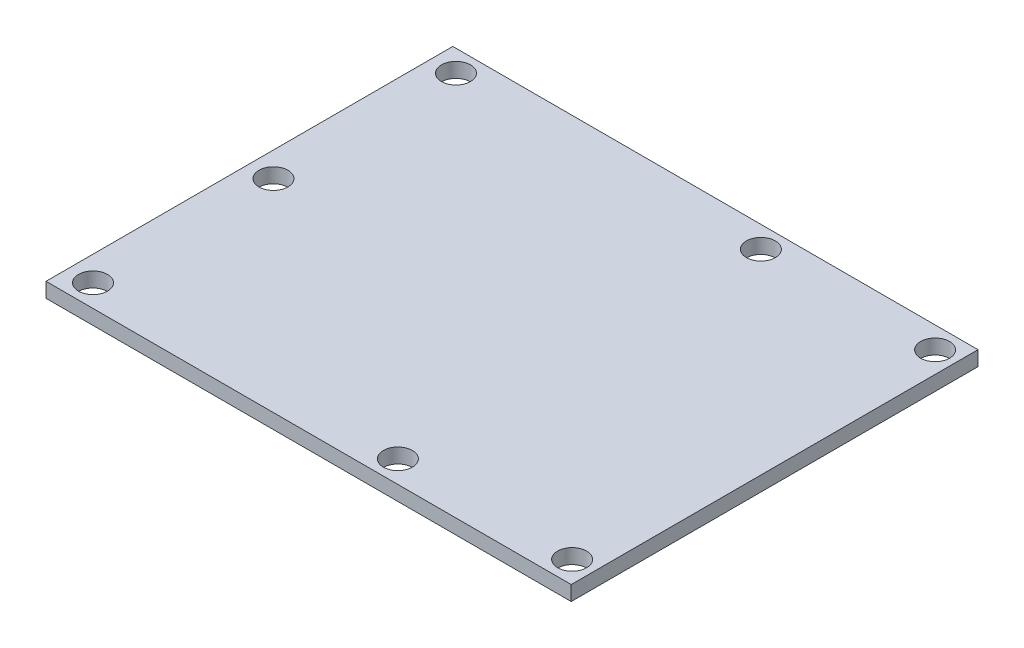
ISO-10303-21;
HEADER;
FILE_DESCRIPTION(('STEP AP214'),'2;1');
FILE_NAME('part.step','',(''),(''),'','','');
FILE_SCHEMA(('AUTOMOTIVE_DESIGN { 1 0 10303 214 1 1 1 1 }'));
ENDSEC;
DATA;
#1=APPLICATION_CONTEXT('core data for automotive mechanical design processes');
#2=APPLICATION_PROTOCOL_DEFINITION('international standard','automotive_design',2000,#1);
#3=PRODUCT_CONTEXT('',#1,'mechanical');
#4=PRODUCT('Part','Part','',(#3));
#5=PRODUCT_RELATED_PRODUCT_CATEGORY('part','',(#4));
#6=PRODUCT_DEFINITION_FORMATION('','',#4);
#7=PRODUCT_DEFINITION_CONTEXT('part definition',#1,'design');
#8=PRODUCT_DEFINITION('design','',#6,#7);
#9=PRODUCT_DEFINITION_SHAPE('','',#8);
#10=(LENGTH_UNIT() NAMED_UNIT(*) SI_UNIT(.MILLI.,.METRE.));
#11=(NAMED_UNIT(*) PLANE_ANGLE_UNIT() SI_UNIT($,.RADIAN.));
#12=(NAMED_UNIT(*) SI_UNIT($,.STERADIAN.) SOLID_ANGLE_UNIT());
#13=UNCERTAINTY_MEASURE_WITH_UNIT(LENGTH_MEASURE(1.E-05),#10,'distance_accuracy_value','');
#14=(GEOMETRIC_REPRESENTATION_CONTEXT(3) GLOBAL_UNCERTAINTY_ASSIGNED_CONTEXT((#13)) GLOBAL_UNIT_ASSIGNED_CONTEXT((#10,
#11,#12)) REPRESENTATION_CONTEXT('',''));
#15=CARTESIAN_POINT('',(0.,0.,0.));
#16=DIRECTION('',(0.,0.,1.));
#17=DIRECTION('',(1.,0.,0.));
#18=AXIS2_PLACEMENT_3D('',#15,#16,#17);
#19=CARTESIAN_POINT('',(-48.8419319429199,-2.,17.094676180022));
#20=DIRECTION('',(-1.,0.,0.));
#21=DIRECTION('',(0.,0.,1.));
#22=AXIS2_PLACEMENT_3D('',#19,#20,#21);
#23=PLANE('',#22);
#24=DIRECTION('',(0.,0.,1.));
#25=VECTOR('',#24,1.);
#26=CARTESIAN_POINT('',(-48.8419319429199,0.,17.094676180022));
#27=LINE('',#26,#25);
#28=CARTESIAN_POINT('',(-48.8419319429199,0.,-38.0269327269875));
#29=VERTEX_POINT('',#28);
#30=CARTESIAN_POINT('',(-48.8419319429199,0.,17.094676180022));
#31=VERTEX_POINT('',#30);
#32=EDGE_CURVE('E99',#29,#31,#27,.T.);
#33=ORIENTED_EDGE('',*,*,#32,.F.);
#34=DIRECTION('',(0.,1.,0.));
#35=VECTOR('',#34,1.);
#36=CARTESIAN_POINT('',(-48.8419319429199,-2.,-38.0269327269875));
#37=LINE('',#36,#35);
#38=CARTESIAN_POINT('',(-48.8419319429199,-2.,-38.0269327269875));
#39=VERTEX_POINT('',#38);
#40=EDGE_CURVE('E11',#39,#29,#37,.T.);
#41=ORIENTED_EDGE('',*,*,#40,.F.);
#42=DIRECTION('',(0.,0.,1.));
#43=VECTOR('',#42,1.);
#44=CARTESIAN_POINT('',(-48.8419319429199,-2.,17.094676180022));
#45=LINE('',#44,#43);
#46=CARTESIAN_POINT('',(-48.8419319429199,-2.,17.094676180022));
#47=VERTEX_POINT('',#46);
#48=EDGE_CURVE('E92',#39,#47,#45,.T.);
#49=ORIENTED_EDGE('',*,*,#48,.T.);
#50=DIRECTION('',(0.,1.,0.));
#51=VECTOR('',#50,1.);
#52=CARTESIAN_POINT('',(-48.8419319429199,-2.,17.094676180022));
#53=LINE('',#52,#51);
#54=EDGE_CURVE('E37',#47,#31,#53,.T.);
#55=ORIENTED_EDGE('',*,*,#54,.T.);
#56=EDGE_LOOP('',(#33,#41,#49,#55));
#57=FACE_BOUND('',#56,.T.);
#58=ADVANCED_FACE('F34',(#57),#23,.T.);
#59=CARTESIAN_POINT('',(-48.8419319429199,-2.,-38.0269327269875));
#60=DIRECTION('',(0.,0.,-1.));
#61=DIRECTION('',(-1.,0.,0.));
#62=AXIS2_PLACEMENT_3D('',#59,#60,#61);
#63=PLANE('',#62);
#64=DIRECTION('',(-1.,0.,0.));
#65=VECTOR('',#64,1.);
#66=CARTESIAN_POINT('',(-48.8419319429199,0.,-38.0269327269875));
#67=LINE('',#66,#65);
#68=CARTESIAN_POINT('',(22.3277403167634,0.,-38.0269327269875));
#69=VERTEX_POINT('',#68);
#70=EDGE_CURVE('E94',#69,#29,#67,.T.);
#71=ORIENTED_EDGE('',*,*,#70,.F.);
#72=DIRECTION('',(0.,1.,0.));
#73=VECTOR('',#72,1.);
#74=CARTESIAN_POINT('',(22.3277403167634,-2.,-38.0269327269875));
#75=LINE('',#74,#73);
#76=CARTESIAN_POINT('',(22.3277403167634,-2.,-38.0269327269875));
#77=VERTEX_POINT('',#76);
#78=EDGE_CURVE('E43',#77,#69,#75,.T.);
#79=ORIENTED_EDGE('',*,*,#78,.F.);
#80=DIRECTION('',(-1.,0.,0.));
#81=VECTOR('',#80,1.);
#82=CARTESIAN_POINT('',(-48.8419319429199,-2.,-38.0269327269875));
#83=LINE('',#82,#81);
#84=EDGE_CURVE('E89',#77,#39,#83,.T.);
#85=ORIENTED_EDGE('',*,*,#84,.T.);
#86=ORIENTED_EDGE('',*,*,#40,.T.);
#87=EDGE_LOOP('',(#71,#79,#85,#86));
#88=FACE_BOUND('',#87,.T.);
#89=ADVANCED_FACE('F110',(#88),#63,.T.);
#90=CARTESIAN_POINT('',(22.3277403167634,-2.,-38.0269327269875));
#91=DIRECTION('',(1.,0.,0.));
#92=DIRECTION('',(0.,0.,-1.));
#93=AXIS2_PLACEMENT_3D('',#90,#91,#92);
#94=PLANE('',#93);
#95=DIRECTION('',(0.,0.,-1.));
#96=VECTOR('',#95,1.);
#97=CARTESIAN_POINT('',(22.3277403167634,0.,-38.0269327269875));
#98=LINE('',#97,#96);
#99=CARTESIAN_POINT('',(22.3277403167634,0.,17.094676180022));
#100=VERTEX_POINT('',#99);
#101=EDGE_CURVE('E84',#100,#69,#98,.T.);
#102=ORIENTED_EDGE('',*,*,#101,.F.);
#103=DIRECTION('',(0.,1.,0.));
#104=VECTOR('',#103,1.);
#105=CARTESIAN_POINT('',(22.3277403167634,-2.,17.094676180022));
#106=LINE('',#105,#104);
#107=CARTESIAN_POINT('',(22.3277403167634,-2.,17.094676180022));
#108=VERTEX_POINT('',#107);
#109=EDGE_CURVE('E79',#108,#100,#106,.T.);
#110=ORIENTED_EDGE('',*,*,#109,.F.);
#111=DIRECTION('',(0.,0.,-1.));
#112=VECTOR('',#111,1.);
#113=CARTESIAN_POINT('',(22.3277403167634,-2.,-38.0269327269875));
#114=LINE('',#113,#112);
#115=EDGE_CURVE('E82',#108,#77,#114,.T.);
#116=ORIENTED_EDGE('',*,*,#115,.T.);
#117=ORIENTED_EDGE('',*,*,#78,.T.);
#118=EDGE_LOOP('',(#102,#110,#116,#117));
#119=FACE_BOUND('',#118,.T.);
#120=ADVANCED_FACE('F81',(#119),#94,.T.);
#121=CARTESIAN_POINT('',(22.3277403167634,-2.,17.094676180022));
#122=DIRECTION('',(0.,0.,1.));
#123=DIRECTION('',(1.,0.,0.));
#124=AXIS2_PLACEMENT_3D('',#121,#122,#123);
#125=PLANE('',#124);
#126=DIRECTION('',(1.,0.,0.));
#127=VECTOR('',#126,1.);
#128=CARTESIAN_POINT('',(22.3277403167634,0.,17.094676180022));
#129=LINE('',#128,#127);
#130=EDGE_CURVE('E102',#31,#100,#129,.T.);
#131=ORIENTED_EDGE('',*,*,#130,.F.);
#132=ORIENTED_EDGE('',*,*,#54,.F.);
#133=DIRECTION('',(1.,0.,0.));
#134=VECTOR('',#133,1.);
#135=CARTESIAN_POINT('',(22.3277403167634,-2.,17.094676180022));
#136=LINE('',#135,#134);
#137=EDGE_CURVE('E88',#47,#108,#136,.T.);
#138=ORIENTED_EDGE('',*,*,#137,.T.);
#139=ORIENTED_EDGE('',*,*,#109,.T.);
#140=EDGE_LOOP('',(#131,#132,#138,#139));
#141=FACE_BOUND('',#140,.T.);
#142=ADVANCED_FACE('F91',(#141),#125,.T.);
#143=CARTESIAN_POINT('',(0.,-2.,0.));
#144=DIRECTION('',(0.,-1.,0.));
#145=DIRECTION('',(0.,0.,-1.));
#146=AXIS2_PLACEMENT_3D('',#143,#144,#145);
#147=PLANE('',#146);
#148=CARTESIAN_POINT('',(-45.48365575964,-2.,14.0853852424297));
#149=DIRECTION('',(0.,-1.,0.));
#150=DIRECTION('',(0.,0.,-1.));
#151=AXIS2_PLACEMENT_3D('',#148,#149,#150);
#152=CIRCLE('',#151,1.96430419);
#153=CARTESIAN_POINT('',(-45.48365575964,-2.,12.1210810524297));
#154=VERTEX_POINT('',#153);
#155=EDGE_CURVE('E103',#154,#154,#152,.T.);
#156=ORIENTED_EDGE('',*,*,#155,.F.);
#157=EDGE_LOOP('',(#156));
#158=FACE_BOUND('',#157,.T.);
#159=CARTESIAN_POINT('',(-4.16742302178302,-2.,14.0853852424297));
#160=DIRECTION('',(0.,-1.,0.));
#161=DIRECTION('',(0.,0.,-1.));
#162=AXIS2_PLACEMENT_3D('',#159,#160,#161);
#163=CIRCLE('',#162,1.96430419);
#164=CARTESIAN_POINT('',(-4.16742302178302,-2.,12.1210810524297));
#165=VERTEX_POINT('',#164);
#166=EDGE_CURVE('E202',#165,#165,#163,.T.);
#167=ORIENTED_EDGE('',*,*,#166,.F.);
#168=EDGE_LOOP('',(#167));
#169=FACE_BOUND('',#168,.T.);
#170=CARTESIAN_POINT('',(19.4418528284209,-2.,14.0853852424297));
#171=DIRECTION('',(0.,-1.,0.));
#172=DIRECTION('',(0.,0.,-1.));
#173=AXIS2_PLACEMENT_3D('',#170,#171,#172);
#174=CIRCLE('',#173,1.96430419);
#175=CARTESIAN_POINT('',(19.4418528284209,-2.,12.1210810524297));
#176=VERTEX_POINT('',#175);
#177=EDGE_CURVE('E199',#176,#176,#174,.T.);
#178=ORIENTED_EDGE('',*,*,#177,.F.);
#179=EDGE_LOOP('',(#178));
#180=FACE_BOUND('',#179,.T.);
#181=CARTESIAN_POINT('',(19.4418528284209,-2.,-35.100606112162));
#182=DIRECTION('',(0.,-1.,0.));
#183=DIRECTION('',(0.,0.,-1.));
#184=AXIS2_PLACEMENT_3D('',#181,#182,#183);
#185=CIRCLE('',#184,1.96430419);
#186=CARTESIAN_POINT('',(19.4418528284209,-2.,-37.064910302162));
#187=VERTEX_POINT('',#186);
#188=EDGE_CURVE('E196',#187,#187,#185,.T.);
#189=ORIENTED_EDGE('',*,*,#188,.F.);
#190=EDGE_LOOP('',(#189));
#191=FACE_BOUND('',#190,.T.);
#192=CARTESIAN_POINT('',(-45.48365575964,-2.,-35.100606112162));
#193=DIRECTION('',(0.,-1.,0.));
#194=DIRECTION('',(0.,0.,-1.));
#195=AXIS2_PLACEMENT_3D('',#192,#193,#194);
#196=CIRCLE('',#195,1.96430419);
#197=CARTESIAN_POINT('',(-45.48365575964,-2.,-37.064910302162));
#198=VERTEX_POINT('',#197);
#199=EDGE_CURVE('E164',#198,#198,#196,.T.);
#200=ORIENTED_EDGE('',*,*,#199,.F.);
#201=EDGE_LOOP('',(#200));
#202=FACE_BOUND('',#201,.T.);
#203=CARTESIAN_POINT('',(-4.16742302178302,-2.,-35.100606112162));
#204=DIRECTION('',(0.,-1.,0.));
#205=DIRECTION('',(0.,0.,-1.));
#206=AXIS2_PLACEMENT_3D('',#203,#204,#205);
#207=CIRCLE('',#206,1.96430419);
#208=CARTESIAN_POINT('',(-4.16742302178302,-2.,-37.064910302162));
#209=VERTEX_POINT('',#208);
#210=EDGE_CURVE('E192',#209,#209,#207,.T.);
#211=ORIENTED_EDGE('',*,*,#210,.F.);
#212=EDGE_LOOP('',(#211));
#213=FACE_BOUND('',#212,.T.);
#214=CARTESIAN_POINT('',(-45.48365575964,-2.,-10.3670790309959));
#215=DIRECTION('',(0.,-1.,0.));
#216=DIRECTION('',(0.,0.,-1.));
#217=AXIS2_PLACEMENT_3D('',#214,#215,#216);
#218=CIRCLE('',#217,1.96430419);
#219=CARTESIAN_POINT('',(-45.48365575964,-2.,-12.3313832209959));
#220=VERTEX_POINT('',#219);
#221=EDGE_CURVE('E189',#220,#220,#218,.T.);
#222=ORIENTED_EDGE('',*,*,#221,.F.);
#223=EDGE_LOOP('',(#222));
#224=FACE_BOUND('',#223,.T.);
#225=ORIENTED_EDGE('',*,*,#48,.F.);
#226=ORIENTED_EDGE('',*,*,#84,.F.);
#227=ORIENTED_EDGE('',*,*,#115,.F.);
#228=ORIENTED_EDGE('',*,*,#137,.F.);
#229=EDGE_LOOP('',(#225,#226,#227,#228));
#230=FACE_BOUND('',#229,.T.);
#231=ADVANCED_FACE('F87',(#158,#169,#180,#191,#202,#213,#224,#230),#147,.T.);
#232=CARTESIAN_POINT('',(0.,0.,0.));
#233=DIRECTION('',(0.,-1.,0.));
#234=DIRECTION('',(0.,0.,-1.));
#235=AXIS2_PLACEMENT_3D('',#232,#233,#234);
#236=PLANE('',#235);
#237=CARTESIAN_POINT('',(-45.48365575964,0.,14.0853852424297));
#238=DIRECTION('',(0.,1.,0.));
#239=DIRECTION('',(0.,0.,1.));
#240=AXIS2_PLACEMENT_3D('',#237,#238,#239);
#241=CIRCLE('',#240,1.96430419);
#242=CARTESIAN_POINT('',(-45.48365575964,0.,16.0496894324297));
#243=VERTEX_POINT('',#242);
#244=EDGE_CURVE('E178',#243,#243,#241,.T.);
#245=ORIENTED_EDGE('',*,*,#244,.F.);
#246=EDGE_LOOP('',(#245));
#247=FACE_BOUND('',#246,.T.);
#248=CARTESIAN_POINT('',(-4.16742302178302,0.,14.0853852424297));
#249=DIRECTION('',(0.,1.,0.));
#250=DIRECTION('',(0.,0.,1.));
#251=AXIS2_PLACEMENT_3D('',#248,#249,#250);
#252=CIRCLE('',#251,1.96430419);
#253=CARTESIAN_POINT('',(-4.16742302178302,0.,16.0496894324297));
#254=VERTEX_POINT('',#253);
#255=EDGE_CURVE('E182',#254,#254,#252,.T.);
#256=ORIENTED_EDGE('',*,*,#255,.F.);
#257=EDGE_LOOP('',(#256));
#258=FACE_BOUND('',#257,.T.);
#259=CARTESIAN_POINT('',(19.4418528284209,0.,14.0853852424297));
#260=DIRECTION('',(0.,1.,0.));
#261=DIRECTION('',(0.,0.,1.));
#262=AXIS2_PLACEMENT_3D('',#259,#260,#261);
#263=CIRCLE('',#262,1.96430419);
#264=CARTESIAN_POINT('',(19.4418528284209,0.,16.0496894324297));
#265=VERTEX_POINT('',#264);
#266=EDGE_CURVE('E173',#265,#265,#263,.T.);
#267=ORIENTED_EDGE('',*,*,#266,.F.);
#268=EDGE_LOOP('',(#267));
#269=FACE_BOUND('',#268,.T.);
#270=CARTESIAN_POINT('',(19.4418528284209,0.,-35.100606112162));
#271=DIRECTION('',(0.,1.,0.));
#272=DIRECTION('',(0.,0.,1.));
#273=AXIS2_PLACEMENT_3D('',#270,#271,#272);
#274=CIRCLE('',#273,1.96430419);
#275=CARTESIAN_POINT('',(19.4418528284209,0.,-33.136301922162));
#276=VERTEX_POINT('',#275);
#277=EDGE_CURVE('E169',#276,#276,#274,.T.);
#278=ORIENTED_EDGE('',*,*,#277,.F.);
#279=EDGE_LOOP('',(#278));
#280=FACE_BOUND('',#279,.T.);
#281=CARTESIAN_POINT('',(-45.48365575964,0.,-35.100606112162));
#282=DIRECTION('',(0.,1.,0.));
#283=DIRECTION('',(0.,0.,1.));
#284=AXIS2_PLACEMENT_3D('',#281,#282,#283);
#285=CIRCLE('',#284,1.96430419);
#286=CARTESIAN_POINT('',(-45.48365575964,0.,-33.136301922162));
#287=VERTEX_POINT('',#286);
#288=EDGE_CURVE('E167',#287,#287,#285,.T.);
#289=ORIENTED_EDGE('',*,*,#288,.F.);
#290=EDGE_LOOP('',(#289));
#291=FACE_BOUND('',#290,.T.);
#292=CARTESIAN_POINT('',(-4.16742302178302,0.,-35.100606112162));
#293=DIRECTION('',(0.,1.,0.));
#294=DIRECTION('',(0.,0.,1.));
#295=AXIS2_PLACEMENT_3D('',#292,#293,#294);
#296=CIRCLE('',#295,1.96430419);
#297=CARTESIAN_POINT('',(-4.16742302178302,0.,-33.136301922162));
#298=VERTEX_POINT('',#297);
#299=EDGE_CURVE('E170',#298,#298,#296,.T.);
#300=ORIENTED_EDGE('',*,*,#299,.F.);
#301=EDGE_LOOP('',(#300));
#302=FACE_BOUND('',#301,.T.);
#303=CARTESIAN_POINT('',(-45.48365575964,0.,-10.3670790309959));
#304=DIRECTION('',(0.,1.,0.));
#305=DIRECTION('',(0.,0.,1.));
#306=AXIS2_PLACEMENT_3D('',#303,#304,#305);
#307=CIRCLE('',#306,1.96430419);
#308=CARTESIAN_POINT('',(-45.48365575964,0.,-8.40277484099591));
#309=VERTEX_POINT('',#308);
#310=EDGE_CURVE('E181',#309,#309,#307,.T.);
#311=ORIENTED_EDGE('',*,*,#310,.F.);
#312=EDGE_LOOP('',(#311));
#313=FACE_BOUND('',#312,.T.);
#314=ORIENTED_EDGE('',*,*,#32,.T.);
#315=ORIENTED_EDGE('',*,*,#130,.T.);
#316=ORIENTED_EDGE('',*,*,#101,.T.);
#317=ORIENTED_EDGE('',*,*,#70,.T.);
#318=EDGE_LOOP('',(#314,#315,#316,#317));
#319=FACE_BOUND('',#318,.T.);
#320=ADVANCED_FACE('F109',(#247,#258,#269,#280,#291,#302,#313,#319),#236,.F.);
#321=CARTESIAN_POINT('',(-45.48365575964,-10.,-10.3670790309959));
#322=DIRECTION('',(0.,1.,0.));
#323=DIRECTION('',(0.,0.,1.));
#324=AXIS2_PLACEMENT_3D('',#321,#322,#323);
#325=CYLINDRICAL_SURFACE('',#324,1.96430419);
#326=ORIENTED_EDGE('',*,*,#221,.T.);
#327=EDGE_LOOP('',(#326));
#328=FACE_BOUND('',#327,.T.);
#329=ORIENTED_EDGE('',*,*,#310,.T.);
#330=EDGE_LOOP('',(#329));
#331=FACE_BOUND('',#330,.T.);
#332=ADVANCED_FACE('F128',(#328,#331),#325,.F.);
#333=CARTESIAN_POINT('',(-4.16742302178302,-10.,-35.100606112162));
#334=DIRECTION('',(0.,1.,0.));
#335=DIRECTION('',(0.,0.,1.));
#336=AXIS2_PLACEMENT_3D('',#333,#334,#335);
#337=CYLINDRICAL_SURFACE('',#336,1.96430419);
#338=ORIENTED_EDGE('',*,*,#210,.T.);
#339=EDGE_LOOP('',(#338));
#340=FACE_BOUND('',#339,.T.);
#341=ORIENTED_EDGE('',*,*,#299,.T.);
#342=EDGE_LOOP('',(#341));
#343=FACE_BOUND('',#342,.T.);
#344=ADVANCED_FACE('F135',(#340,#343),#337,.F.);
#345=CARTESIAN_POINT('',(-45.48365575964,-10.,-35.100606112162));
#346=DIRECTION('',(0.,1.,0.));
#347=DIRECTION('',(0.,0.,1.));
#348=AXIS2_PLACEMENT_3D('',#345,#346,#347);
#349=CYLINDRICAL_SURFACE('',#348,1.96430419);
#350=ORIENTED_EDGE('',*,*,#199,.T.);
#351=EDGE_LOOP('',(#350));
#352=FACE_BOUND('',#351,.T.);
#353=ORIENTED_EDGE('',*,*,#288,.T.);
#354=EDGE_LOOP('',(#353));
#355=FACE_BOUND('',#354,.T.);
#356=ADVANCED_FACE('F141',(#352,#355),#349,.F.);
#357=CARTESIAN_POINT('',(19.4418528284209,-10.,-35.100606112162));
#358=DIRECTION('',(0.,1.,0.));
#359=DIRECTION('',(0.,0.,1.));
#360=AXIS2_PLACEMENT_3D('',#357,#358,#359);
#361=CYLINDRICAL_SURFACE('',#360,1.96430419);
#362=ORIENTED_EDGE('',*,*,#188,.T.);
#363=EDGE_LOOP('',(#362));
#364=FACE_BOUND('',#363,.T.);
#365=ORIENTED_EDGE('',*,*,#277,.T.);
#366=EDGE_LOOP('',(#365));
#367=FACE_BOUND('',#366,.T.);
#368=ADVANCED_FACE('F137',(#364,#367),#361,.F.);
#369=CARTESIAN_POINT('',(19.4418528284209,-10.,14.0853852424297));
#370=DIRECTION('',(0.,1.,0.));
#371=DIRECTION('',(0.,0.,1.));
#372=AXIS2_PLACEMENT_3D('',#369,#370,#371);
#373=CYLINDRICAL_SURFACE('',#372,1.96430419);
#374=ORIENTED_EDGE('',*,*,#177,.T.);
#375=EDGE_LOOP('',(#374));
#376=FACE_BOUND('',#375,.T.);
#377=ORIENTED_EDGE('',*,*,#266,.T.);
#378=EDGE_LOOP('',(#377));
#379=FACE_BOUND('',#378,.T.);
#380=ADVANCED_FACE('F140',(#376,#379),#373,.F.);
#381=CARTESIAN_POINT('',(-4.16742302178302,-10.,14.0853852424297));
#382=DIRECTION('',(0.,1.,0.));
#383=DIRECTION('',(0.,0.,1.));
#384=AXIS2_PLACEMENT_3D('',#381,#382,#383);
#385=CYLINDRICAL_SURFACE('',#384,1.96430419);
#386=ORIENTED_EDGE('',*,*,#166,.T.);
#387=EDGE_LOOP('',(#386));
#388=FACE_BOUND('',#387,.T.);
#389=ORIENTED_EDGE('',*,*,#255,.T.);
#390=EDGE_LOOP('',(#389));
#391=FACE_BOUND('',#390,.T.);
#392=ADVANCED_FACE('F145',(#388,#391),#385,.F.);
#393=CARTESIAN_POINT('',(-45.48365575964,-10.,14.0853852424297));
#394=DIRECTION('',(0.,1.,0.));
#395=DIRECTION('',(0.,0.,1.));
#396=AXIS2_PLACEMENT_3D('',#393,#394,#395);
#397=CYLINDRICAL_SURFACE('',#396,1.96430419);
#398=ORIENTED_EDGE('',*,*,#155,.T.);
#399=EDGE_LOOP('',(#398));
#400=FACE_BOUND('',#399,.T.);
#401=ORIENTED_EDGE('',*,*,#244,.T.);
#402=EDGE_LOOP('',(#401));
#403=FACE_BOUND('',#402,.T.);
#404=ADVANCED_FACE('F149',(#400,#403),#397,.F.);
#405=CLOSED_SHELL('',(#58,#89,#120,#142,#231,#320,#332,#344,#356,#368,#380,#392,#404));
#406=MANIFOLD_SOLID_BREP('B2',#405);
#407=ADVANCED_BREP_SHAPE_REPRESENTATION('',(#18,#406),#14);
#408=SHAPE_DEFINITION_REPRESENTATION(#9,#407);
ENDSEC;
END-ISO-10303-21;
